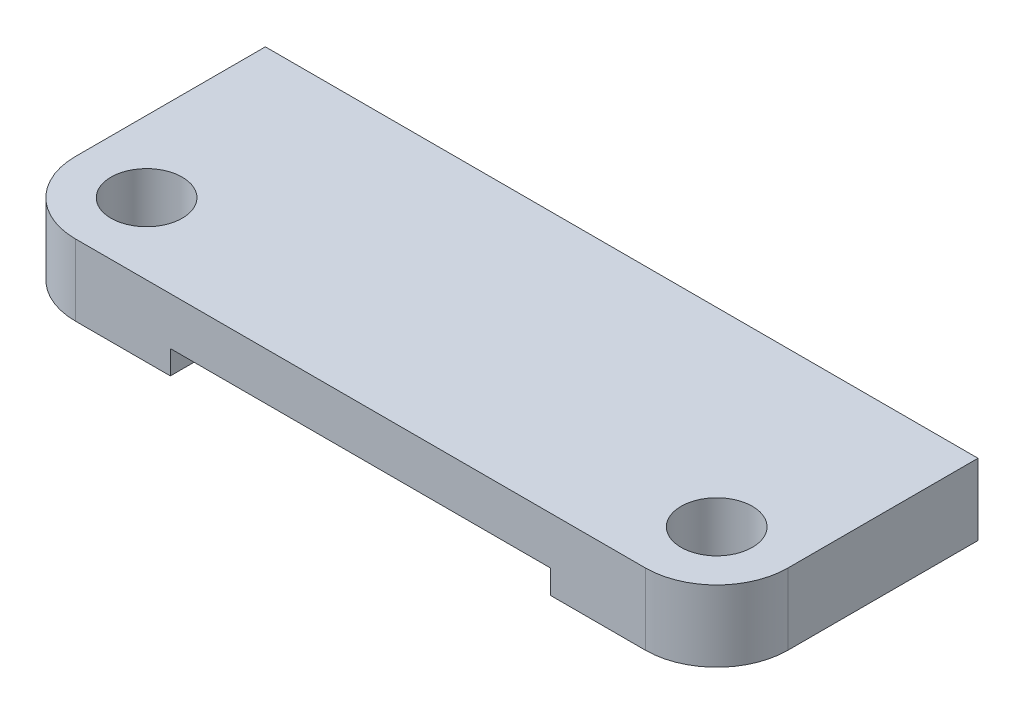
from build123d import *

# Parameters (mm, degrees)
SKETCH_1_R          = 3
EXTRUDE_1_DEPTH     = 6
SKETCH_2_W          = 32
SKETCH_2_H          = 2
CUT_EXTRUDE_1_DEPTH = 38.682887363


with BuildPart() as part:
    # Sketch 1 → Extrude 1 (new body)
    with BuildSketch(Plane(origin=(0, 0, 0), x_dir=(1, 0, 0), z_dir=(0, 1, 0))):
        with BuildLine():
            Line((30, 0), (-30, 0))
            Line((-30, 0), (-30, -16))
            ThreePointArc((-30, -16), (-28.242640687, -20.242640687), (-24, -22))
            Line((-24, -22), (24, -22))
            ThreePointArc((24, -22), (28.242640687, -20.242640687), (30, -16))
            Line((30, -16), (30, 0))
        make_face()
        with Locations(Location((-24, -16, 0), (0, 0, 270))):
            Circle(SKETCH_1_R, mode=Mode.SUBTRACT)
        with Locations(Location((24, -16, 0), (0, 0, 90))):
            Circle(SKETCH_1_R, mode=Mode.SUBTRACT)
    extrude(amount=EXTRUDE_1_DEPTH)

    # Sketch 2 → Cut-Extrude 1 (cut, through all)
    with BuildSketch(Plane.XY.offset(22)):
        with Locations((0, 1)):
            Rectangle(SKETCH_2_W, SKETCH_2_H)
    extrude(amount=-CUT_EXTRUDE_1_DEPTH, mode=Mode.SUBTRACT)


solid = part.part
